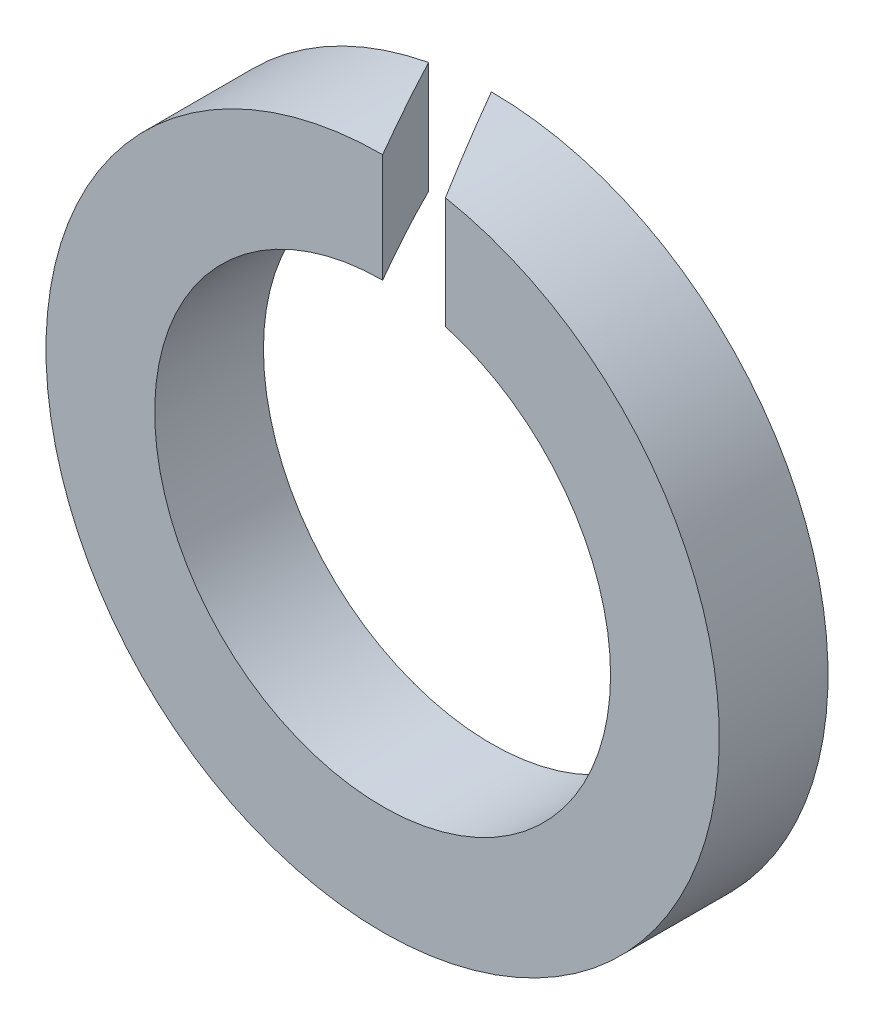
from build123d import *

# Parameters (mm, degrees)
SKETCH1_R          = 8.05
SKETCH1_R_2        = 5.45
BASE_EXTRUDE_DEPTH = 2.6
CUT_EXTRUDE1_DEPTH = 12.67754255


with BuildPart() as part:
    # Sketch1 → Base-Extrude (new body)
    with BuildSketch(Plane.XY):
        Circle(SKETCH1_R)
        Circle(SKETCH1_R_2, mode=Mode.SUBTRACT)
    extrude(amount=-BASE_EXTRUDE_DEPTH)

    # Sketch2 → Cut-Extrude1 (cut, through all)
    with BuildSketch(Plane(origin=(0, 0, 0), x_dir=(1, 0, 0), z_dir=(0, 1, 0))):
        Polygon((0, 2.6), (1.5011107, 0), (0, 0), (-1.5011107, 2.6), align=None)
    extrude(amount=CUT_EXTRUDE1_DEPTH, mode=Mode.SUBTRACT)


solid = part.part
